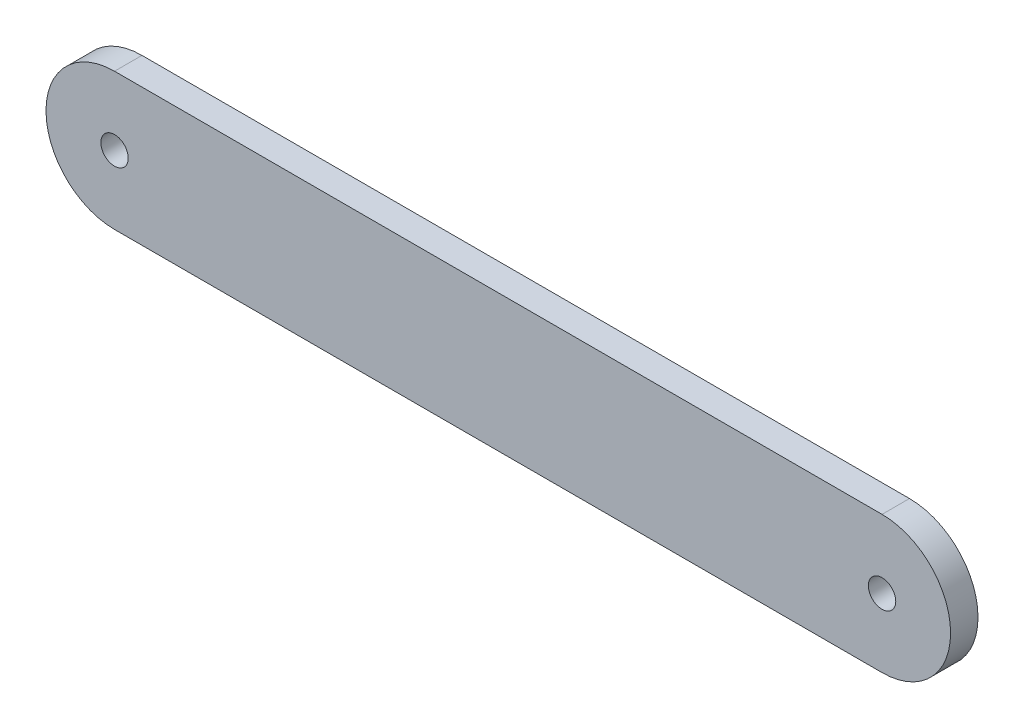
from build123d import *

# Parameters (mm, degrees)
BOSS_EXTRU_1_DEPTH      = 10
ESQUISSE2_R             = 5
ENL_V_MAT_EXTRU_1_DEPTH = 307.186217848


with BuildPart() as part:
    # Esquisse1 → Boss.-Extru.1 (new body)
    with BuildSketch(Plane.XY):
        with BuildLine():
            Line((0, 25), (280, 25))
            ThreePointArc((280, 25), (305, 0), (280, -25))
            Line((280, -25), (0, -25))
            ThreePointArc((0, -25), (-25, 0), (0, 25))
        make_face()
    extrude(amount=BOSS_EXTRU_1_DEPTH)

    # Esquisse2 → Enl_v. mat.-Extru.1 (cut, through all)
    with BuildSketch(Plane.XY.offset(10)):
        Circle(ESQUISSE2_R)
        with Locations((280, 0)):
            Circle(ESQUISSE2_R)
    extrude(amount=-ENL_V_MAT_EXTRU_1_DEPTH, mode=Mode.SUBTRACT)


solid = part.part
